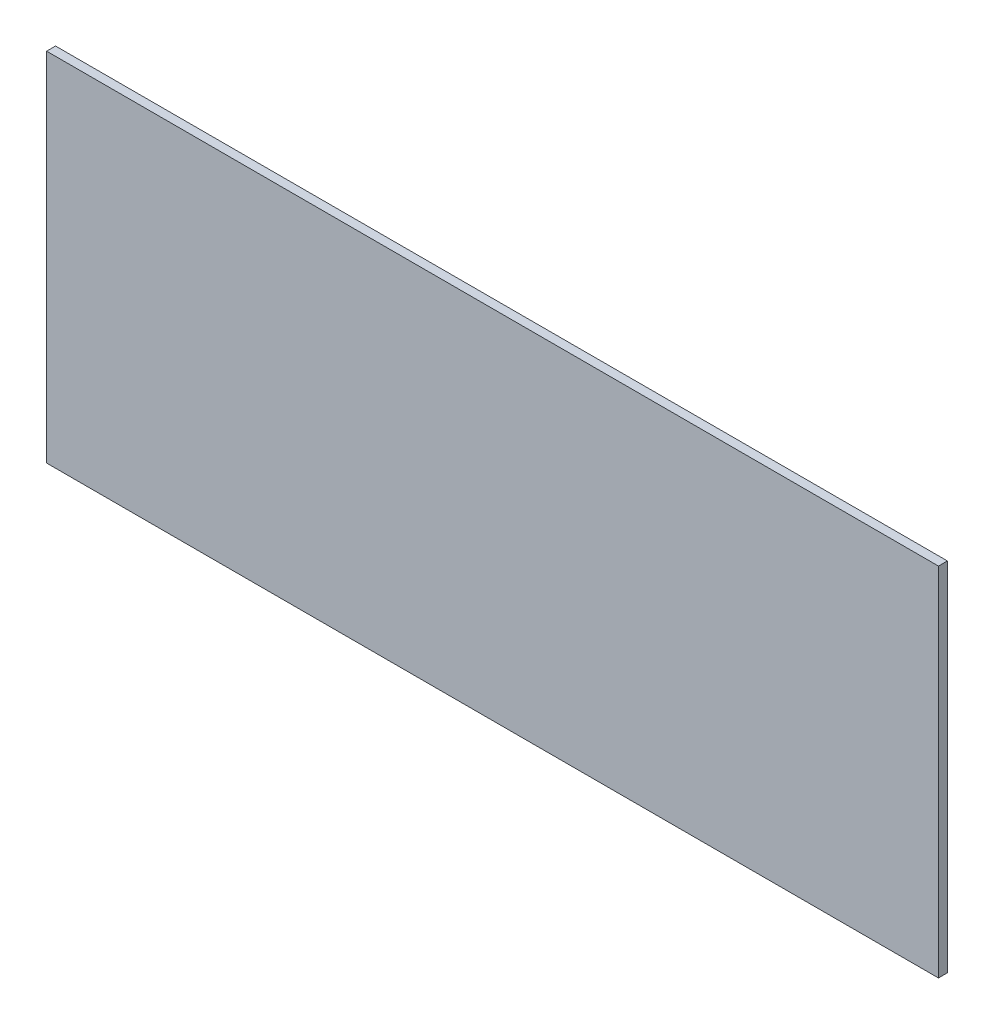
from build123d import *

# Parameters (mm, degrees)
SKETCH1_W           = 10
SKETCH1_H           = 4
BOSS_EXTRUDE1_DEPTH = 0.1


with BuildPart() as part:
    # Sketch1 → Boss-Extrude1 (new body)
    with BuildSketch(Plane.XY):
        with Locations((5, 2)):
            Rectangle(SKETCH1_W, SKETCH1_H)
    extrude(amount=BOSS_EXTRUDE1_DEPTH)


solid = part.part
